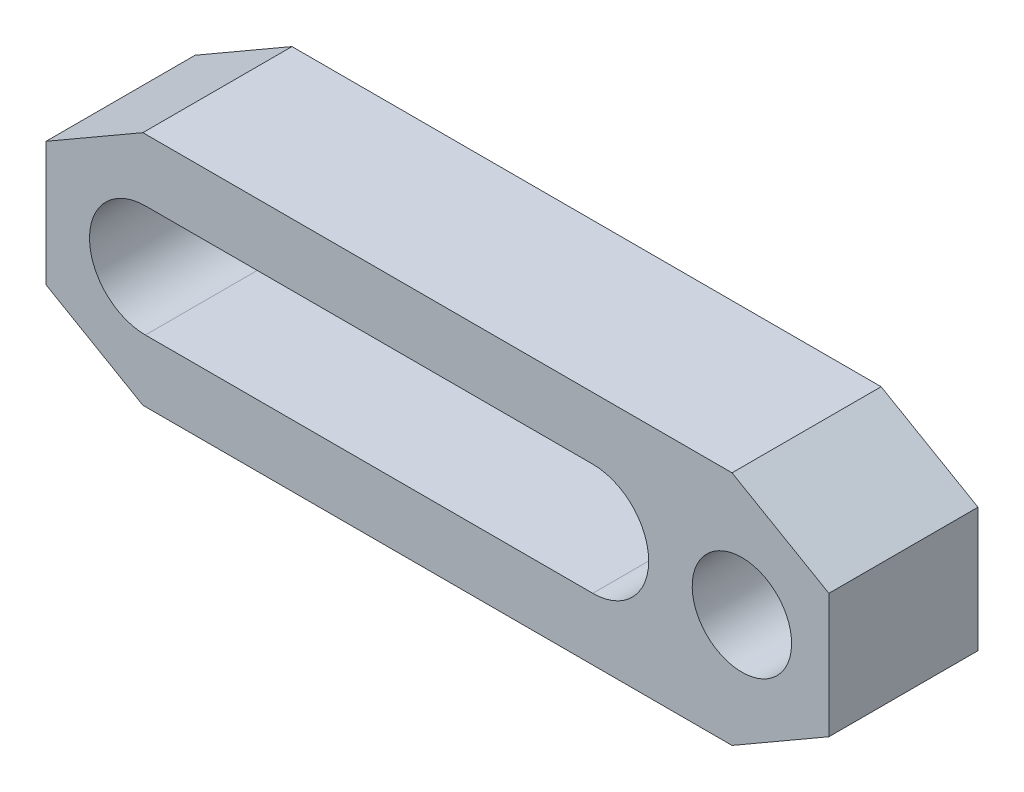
ISO-10303-21;
HEADER;
FILE_DESCRIPTION(('STEP AP214'),'2;1');
FILE_NAME('part.step','',(''),(''),'','','');
FILE_SCHEMA(('AUTOMOTIVE_DESIGN { 1 0 10303 214 1 1 1 1 }'));
ENDSEC;
DATA;
#1=APPLICATION_CONTEXT('core data for automotive mechanical design processes');
#2=APPLICATION_PROTOCOL_DEFINITION('international standard','automotive_design',2000,#1);
#3=PRODUCT_CONTEXT('',#1,'mechanical');
#4=PRODUCT('Part','Part','',(#3));
#5=PRODUCT_RELATED_PRODUCT_CATEGORY('part','',(#4));
#6=PRODUCT_DEFINITION_FORMATION('','',#4);
#7=PRODUCT_DEFINITION_CONTEXT('part definition',#1,'design');
#8=PRODUCT_DEFINITION('design','',#6,#7);
#9=PRODUCT_DEFINITION_SHAPE('','',#8);
#10=(LENGTH_UNIT() NAMED_UNIT(*) SI_UNIT(.MILLI.,.METRE.));
#11=(NAMED_UNIT(*) PLANE_ANGLE_UNIT() SI_UNIT($,.RADIAN.));
#12=(NAMED_UNIT(*) SI_UNIT($,.STERADIAN.) SOLID_ANGLE_UNIT());
#13=UNCERTAINTY_MEASURE_WITH_UNIT(LENGTH_MEASURE(1.E-05),#10,'distance_accuracy_value','');
#14=(GEOMETRIC_REPRESENTATION_CONTEXT(3) GLOBAL_UNCERTAINTY_ASSIGNED_CONTEXT((#13)) GLOBAL_UNIT_ASSIGNED_CONTEXT((#10,
#11,#12)) REPRESENTATION_CONTEXT('',''));
#15=CARTESIAN_POINT('',(0.,0.,0.));
#16=DIRECTION('',(0.,0.,1.));
#17=DIRECTION('',(1.,0.,0.));
#18=AXIS2_PLACEMENT_3D('',#15,#16,#17);
#19=CARTESIAN_POINT('',(-12.5,23.1865334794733,12.));
#20=DIRECTION('',(0.,0.,1.));
#21=DIRECTION('',(0.,1.,0.));
#22=AXIS2_PLACEMENT_3D('',#19,#20,#21);
#23=PLANE('',#22);
#24=CARTESIAN_POINT('',(12.,0.,12.));
#25=DIRECTION('',(0.,0.,1.));
#26=DIRECTION('',(0.,1.,0.));
#27=AXIS2_PLACEMENT_3D('',#24,#25,#26);
#28=CIRCLE('',#27,4.);
#29=CARTESIAN_POINT('',(12.,4.,12.));
#30=VERTEX_POINT('',#29);
#31=EDGE_CURVE('E124',#30,#30,#28,.T.);
#32=ORIENTED_EDGE('',*,*,#31,.F.);
#33=EDGE_LOOP('',(#32));
#34=FACE_BOUND('',#33,.T.);
#35=DIRECTION('',(-0.866025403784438,-0.5,0.));
#36=VECTOR('',#35,1.);
#37=CARTESIAN_POINT('',(-44.,5.,12.));
#38=LINE('',#37,#36);
#39=CARTESIAN_POINT('',(-36.2057713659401,9.5,12.));
#40=VERTEX_POINT('',#39);
#41=CARTESIAN_POINT('',(-44.,5.,12.));
#42=VERTEX_POINT('',#41);
#43=EDGE_CURVE('E160',#40,#42,#38,.T.);
#44=ORIENTED_EDGE('',*,*,#43,.T.);
#45=DIRECTION('',(0.,-1.,0.));
#46=VECTOR('',#45,1.);
#47=CARTESIAN_POINT('',(-44.,-5.,12.));
#48=LINE('',#47,#46);
#49=CARTESIAN_POINT('',(-44.,-5.,12.));
#50=VERTEX_POINT('',#49);
#51=EDGE_CURVE('E163',#42,#50,#48,.T.);
#52=ORIENTED_EDGE('',*,*,#51,.T.);
#53=DIRECTION('',(0.866025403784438,-0.5,0.));
#54=VECTOR('',#53,1.);
#55=CARTESIAN_POINT('',(-44.,-5.,12.));
#56=LINE('',#55,#54);
#57=CARTESIAN_POINT('',(-36.2057713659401,-9.5,12.));
#58=VERTEX_POINT('',#57);
#59=EDGE_CURVE('E165',#50,#58,#56,.T.);
#60=ORIENTED_EDGE('',*,*,#59,.T.);
#61=DIRECTION('',(1.,0.,0.));
#62=VECTOR('',#61,1.);
#63=CARTESIAN_POINT('',(11.2057713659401,-9.5,12.));
#64=LINE('',#63,#62);
#65=CARTESIAN_POINT('',(11.2057713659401,-9.5,12.));
#66=VERTEX_POINT('',#65);
#67=EDGE_CURVE('E167',#58,#66,#64,.T.);
#68=ORIENTED_EDGE('',*,*,#67,.T.);
#69=DIRECTION('',(0.866025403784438,0.5,0.));
#70=VECTOR('',#69,1.);
#71=CARTESIAN_POINT('',(19.,-5.,12.));
#72=LINE('',#71,#70);
#73=CARTESIAN_POINT('',(19.,-5.,12.));
#74=VERTEX_POINT('',#73);
#75=EDGE_CURVE('E169',#66,#74,#72,.T.);
#76=ORIENTED_EDGE('',*,*,#75,.T.);
#77=DIRECTION('',(0.,1.,0.));
#78=VECTOR('',#77,1.);
#79=CARTESIAN_POINT('',(19.,-5.,12.));
#80=LINE('',#79,#78);
#81=CARTESIAN_POINT('',(19.,5.,12.));
#82=VERTEX_POINT('',#81);
#83=EDGE_CURVE('E171',#74,#82,#80,.T.);
#84=ORIENTED_EDGE('',*,*,#83,.T.);
#85=DIRECTION('',(-0.866025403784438,0.5,0.));
#86=VECTOR('',#85,1.);
#87=CARTESIAN_POINT('',(19.,5.,12.));
#88=LINE('',#87,#86);
#89=CARTESIAN_POINT('',(11.2057713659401,9.5,12.));
#90=VERTEX_POINT('',#89);
#91=EDGE_CURVE('E173',#82,#90,#88,.T.);
#92=ORIENTED_EDGE('',*,*,#91,.T.);
#93=DIRECTION('',(-1.,0.,0.));
#94=VECTOR('',#93,1.);
#95=CARTESIAN_POINT('',(11.2057713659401,9.5,12.));
#96=LINE('',#95,#94);
#97=EDGE_CURVE('E175',#90,#40,#96,.T.);
#98=ORIENTED_EDGE('',*,*,#97,.T.);
#99=EDGE_LOOP('',(#44,#52,#60,#68,#76,#84,#92,#98));
#100=FACE_BOUND('',#99,.T.);
#101=DIRECTION('',(-1.,0.,0.));
#102=VECTOR('',#101,1.);
#103=CARTESIAN_POINT('',(0.,4.5,12.));
#104=LINE('',#103,#102);
#105=CARTESIAN_POINT('',(0.,4.5,12.));
#106=VERTEX_POINT('',#105);
#107=CARTESIAN_POINT('',(-36.,4.5,12.));
#108=VERTEX_POINT('',#107);
#109=EDGE_CURVE('E134',#106,#108,#104,.T.);
#110=ORIENTED_EDGE('',*,*,#109,.F.);
#111=CARTESIAN_POINT('',(0.,0.,12.));
#112=DIRECTION('',(0.,0.,1.));
#113=DIRECTION('',(0.,1.,0.));
#114=AXIS2_PLACEMENT_3D('',#111,#112,#113);
#115=CIRCLE('',#114,4.5);
#116=CARTESIAN_POINT('',(0.,-4.5,12.));
#117=VERTEX_POINT('',#116);
#118=EDGE_CURVE('E118',#117,#106,#115,.T.);
#119=ORIENTED_EDGE('',*,*,#118,.F.);
#120=DIRECTION('',(1.,0.,0.));
#121=VECTOR('',#120,1.);
#122=CARTESIAN_POINT('',(0.,-4.5,12.));
#123=LINE('',#122,#121);
#124=CARTESIAN_POINT('',(-36.,-4.5,12.));
#125=VERTEX_POINT('',#124);
#126=EDGE_CURVE('E138',#125,#117,#123,.T.);
#127=ORIENTED_EDGE('',*,*,#126,.F.);
#128=CARTESIAN_POINT('',(-36.,0.,12.));
#129=DIRECTION('',(0.,0.,1.));
#130=DIRECTION('',(0.,1.,0.));
#131=AXIS2_PLACEMENT_3D('',#128,#129,#130);
#132=CIRCLE('',#131,4.5);
#133=EDGE_CURVE('E136',#108,#125,#132,.T.);
#134=ORIENTED_EDGE('',*,*,#133,.F.);
#135=EDGE_LOOP('',(#110,#119,#127,#134));
#136=FACE_BOUND('',#135,.T.);
#137=ADVANCED_FACE('F14',(#34,#100,#136),#23,.T.);
#138=CARTESIAN_POINT('',(-12.5,23.1865334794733,0.));
#139=DIRECTION('',(0.,0.,1.));
#140=DIRECTION('',(0.,1.,0.));
#141=AXIS2_PLACEMENT_3D('',#138,#139,#140);
#142=PLANE('',#141);
#143=CARTESIAN_POINT('',(12.,0.,0.));
#144=DIRECTION('',(0.,0.,1.));
#145=DIRECTION('',(0.,1.,0.));
#146=AXIS2_PLACEMENT_3D('',#143,#144,#145);
#147=CIRCLE('',#146,4.);
#148=CARTESIAN_POINT('',(12.,4.,0.));
#149=VERTEX_POINT('',#148);
#150=EDGE_CURVE('E127',#149,#149,#147,.T.);
#151=ORIENTED_EDGE('',*,*,#150,.T.);
#152=EDGE_LOOP('',(#151));
#153=FACE_BOUND('',#152,.T.);
#154=DIRECTION('',(-0.866025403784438,-0.5,0.));
#155=VECTOR('',#154,1.);
#156=CARTESIAN_POINT('',(-44.,5.,0.));
#157=LINE('',#156,#155);
#158=CARTESIAN_POINT('',(-36.2057713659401,9.5,0.));
#159=VERTEX_POINT('',#158);
#160=CARTESIAN_POINT('',(-44.,5.,0.));
#161=VERTEX_POINT('',#160);
#162=EDGE_CURVE('E119',#159,#161,#157,.T.);
#163=ORIENTED_EDGE('',*,*,#162,.F.);
#164=DIRECTION('',(-1.,0.,0.));
#165=VECTOR('',#164,1.);
#166=CARTESIAN_POINT('',(11.2057713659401,9.5,0.));
#167=LINE('',#166,#165);
#168=CARTESIAN_POINT('',(11.2057713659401,9.5,0.));
#169=VERTEX_POINT('',#168);
#170=EDGE_CURVE('E158',#169,#159,#167,.T.);
#171=ORIENTED_EDGE('',*,*,#170,.F.);
#172=DIRECTION('',(-0.866025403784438,0.5,0.));
#173=VECTOR('',#172,1.);
#174=CARTESIAN_POINT('',(19.,5.,0.));
#175=LINE('',#174,#173);
#176=CARTESIAN_POINT('',(19.,5.,0.));
#177=VERTEX_POINT('',#176);
#178=EDGE_CURVE('E156',#177,#169,#175,.T.);
#179=ORIENTED_EDGE('',*,*,#178,.F.);
#180=DIRECTION('',(0.,1.,0.));
#181=VECTOR('',#180,1.);
#182=CARTESIAN_POINT('',(19.,-5.,0.));
#183=LINE('',#182,#181);
#184=CARTESIAN_POINT('',(19.,-5.,0.));
#185=VERTEX_POINT('',#184);
#186=EDGE_CURVE('E154',#185,#177,#183,.T.);
#187=ORIENTED_EDGE('',*,*,#186,.F.);
#188=DIRECTION('',(0.866025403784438,0.5,0.));
#189=VECTOR('',#188,1.);
#190=CARTESIAN_POINT('',(19.,-5.,0.));
#191=LINE('',#190,#189);
#192=CARTESIAN_POINT('',(11.2057713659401,-9.5,0.));
#193=VERTEX_POINT('',#192);
#194=EDGE_CURVE('E152',#193,#185,#191,.T.);
#195=ORIENTED_EDGE('',*,*,#194,.F.);
#196=DIRECTION('',(1.,0.,0.));
#197=VECTOR('',#196,1.);
#198=CARTESIAN_POINT('',(11.2057713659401,-9.5,0.));
#199=LINE('',#198,#197);
#200=CARTESIAN_POINT('',(-36.2057713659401,-9.5,0.));
#201=VERTEX_POINT('',#200);
#202=EDGE_CURVE('E150',#201,#193,#199,.T.);
#203=ORIENTED_EDGE('',*,*,#202,.F.);
#204=DIRECTION('',(0.866025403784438,-0.5,0.));
#205=VECTOR('',#204,1.);
#206=CARTESIAN_POINT('',(-44.,-5.,0.));
#207=LINE('',#206,#205);
#208=CARTESIAN_POINT('',(-44.,-5.,0.));
#209=VERTEX_POINT('',#208);
#210=EDGE_CURVE('E148',#209,#201,#207,.T.);
#211=ORIENTED_EDGE('',*,*,#210,.F.);
#212=DIRECTION('',(0.,-1.,0.));
#213=VECTOR('',#212,1.);
#214=CARTESIAN_POINT('',(-44.,-5.,0.));
#215=LINE('',#214,#213);
#216=EDGE_CURVE('E146',#161,#209,#215,.T.);
#217=ORIENTED_EDGE('',*,*,#216,.F.);
#218=EDGE_LOOP('',(#163,#171,#179,#187,#195,#203,#211,#217));
#219=FACE_BOUND('',#218,.T.);
#220=CARTESIAN_POINT('',(0.,0.,0.));
#221=DIRECTION('',(0.,0.,1.));
#222=DIRECTION('',(0.,1.,0.));
#223=AXIS2_PLACEMENT_3D('',#220,#221,#222);
#224=CIRCLE('',#223,4.5);
#225=CARTESIAN_POINT('',(0.,-4.5,0.));
#226=VERTEX_POINT('',#225);
#227=CARTESIAN_POINT('',(0.,4.5,0.));
#228=VERTEX_POINT('',#227);
#229=EDGE_CURVE('E37',#226,#228,#224,.T.);
#230=ORIENTED_EDGE('',*,*,#229,.T.);
#231=DIRECTION('',(-1.,0.,0.));
#232=VECTOR('',#231,1.);
#233=CARTESIAN_POINT('',(0.,4.5,0.));
#234=LINE('',#233,#232);
#235=CARTESIAN_POINT('',(-36.,4.5,0.));
#236=VERTEX_POINT('',#235);
#237=EDGE_CURVE('E105',#228,#236,#234,.T.);
#238=ORIENTED_EDGE('',*,*,#237,.T.);
#239=CARTESIAN_POINT('',(-36.,0.,0.));
#240=DIRECTION('',(0.,0.,1.));
#241=DIRECTION('',(0.,1.,0.));
#242=AXIS2_PLACEMENT_3D('',#239,#240,#241);
#243=CIRCLE('',#242,4.5);
#244=CARTESIAN_POINT('',(-36.,-4.5,0.));
#245=VERTEX_POINT('',#244);
#246=EDGE_CURVE('E114',#236,#245,#243,.T.);
#247=ORIENTED_EDGE('',*,*,#246,.T.);
#248=DIRECTION('',(1.,0.,0.));
#249=VECTOR('',#248,1.);
#250=CARTESIAN_POINT('',(0.,-4.5,0.));
#251=LINE('',#250,#249);
#252=EDGE_CURVE('E123',#245,#226,#251,.T.);
#253=ORIENTED_EDGE('',*,*,#252,.T.);
#254=EDGE_LOOP('',(#230,#238,#247,#253));
#255=FACE_BOUND('',#254,.T.);
#256=ADVANCED_FACE('F122',(#153,#219,#255),#142,.F.);
#257=CARTESIAN_POINT('',(-44.,5.,12.));
#258=DIRECTION('',(0.5,-0.866025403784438,0.));
#259=DIRECTION('',(0.866025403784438,0.5,0.));
#260=AXIS2_PLACEMENT_3D('',#257,#258,#259);
#261=PLANE('',#260);
#262=ORIENTED_EDGE('',*,*,#162,.T.);
#263=DIRECTION('',(0.,0.,-1.));
#264=VECTOR('',#263,1.);
#265=CARTESIAN_POINT('',(-44.,5.,12.));
#266=LINE('',#265,#264);
#267=EDGE_CURVE('E9',#42,#161,#266,.T.);
#268=ORIENTED_EDGE('',*,*,#267,.F.);
#269=ORIENTED_EDGE('',*,*,#43,.F.);
#270=DIRECTION('',(0.,0.,-1.));
#271=VECTOR('',#270,1.);
#272=CARTESIAN_POINT('',(-36.2057713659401,9.5,12.));
#273=LINE('',#272,#271);
#274=EDGE_CURVE('E177',#40,#159,#273,.T.);
#275=ORIENTED_EDGE('',*,*,#274,.T.);
#276=EDGE_LOOP('',(#262,#268,#269,#275));
#277=FACE_BOUND('',#276,.T.);
#278=ADVANCED_FACE('F16',(#277),#261,.F.);
#279=CARTESIAN_POINT('',(-44.,-5.,12.));
#280=DIRECTION('',(1.,0.,0.));
#281=DIRECTION('',(0.,1.,0.));
#282=AXIS2_PLACEMENT_3D('',#279,#280,#281);
#283=PLANE('',#282);
#284=ORIENTED_EDGE('',*,*,#216,.T.);
#285=DIRECTION('',(0.,0.,-1.));
#286=VECTOR('',#285,1.);
#287=CARTESIAN_POINT('',(-44.,-5.,12.));
#288=LINE('',#287,#286);
#289=EDGE_CURVE('E22',#50,#209,#288,.T.);
#290=ORIENTED_EDGE('',*,*,#289,.F.);
#291=ORIENTED_EDGE('',*,*,#51,.F.);
#292=ORIENTED_EDGE('',*,*,#267,.T.);
#293=EDGE_LOOP('',(#284,#290,#291,#292));
#294=FACE_BOUND('',#293,.T.);
#295=ADVANCED_FACE('F221',(#294),#283,.F.);
#296=CARTESIAN_POINT('',(-44.,-5.,12.));
#297=DIRECTION('',(0.5,0.866025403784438,0.));
#298=DIRECTION('',(-0.866025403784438,0.5,0.));
#299=AXIS2_PLACEMENT_3D('',#296,#297,#298);
#300=PLANE('',#299);
#301=ORIENTED_EDGE('',*,*,#210,.T.);
#302=DIRECTION('',(0.,0.,-1.));
#303=VECTOR('',#302,1.);
#304=CARTESIAN_POINT('',(-36.2057713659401,-9.5,12.));
#305=LINE('',#304,#303);
#306=EDGE_CURVE('E192',#58,#201,#305,.T.);
#307=ORIENTED_EDGE('',*,*,#306,.F.);
#308=ORIENTED_EDGE('',*,*,#59,.F.);
#309=ORIENTED_EDGE('',*,*,#289,.T.);
#310=EDGE_LOOP('',(#301,#307,#308,#309));
#311=FACE_BOUND('',#310,.T.);
#312=ADVANCED_FACE('F199',(#311),#300,.F.);
#313=CARTESIAN_POINT('',(11.2057713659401,-9.5,12.));
#314=DIRECTION('',(0.,1.,0.));
#315=DIRECTION('',(-1.,0.,0.));
#316=AXIS2_PLACEMENT_3D('',#313,#314,#315);
#317=PLANE('',#316);
#318=ORIENTED_EDGE('',*,*,#202,.T.);
#319=DIRECTION('',(0.,0.,-1.));
#320=VECTOR('',#319,1.);
#321=CARTESIAN_POINT('',(11.2057713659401,-9.5,12.));
#322=LINE('',#321,#320);
#323=EDGE_CURVE('E189',#66,#193,#322,.T.);
#324=ORIENTED_EDGE('',*,*,#323,.F.);
#325=ORIENTED_EDGE('',*,*,#67,.F.);
#326=ORIENTED_EDGE('',*,*,#306,.T.);
#327=EDGE_LOOP('',(#318,#324,#325,#326));
#328=FACE_BOUND('',#327,.T.);
#329=ADVANCED_FACE('F209',(#328),#317,.F.);
#330=CARTESIAN_POINT('',(19.,-5.,12.));
#331=DIRECTION('',(-0.5,0.866025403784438,0.));
#332=DIRECTION('',(-0.866025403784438,-0.5,0.));
#333=AXIS2_PLACEMENT_3D('',#330,#331,#332);
#334=PLANE('',#333);
#335=ORIENTED_EDGE('',*,*,#194,.T.);
#336=DIRECTION('',(0.,0.,-1.));
#337=VECTOR('',#336,1.);
#338=CARTESIAN_POINT('',(19.,-5.,12.));
#339=LINE('',#338,#337);
#340=EDGE_CURVE('E186',#74,#185,#339,.T.);
#341=ORIENTED_EDGE('',*,*,#340,.F.);
#342=ORIENTED_EDGE('',*,*,#75,.F.);
#343=ORIENTED_EDGE('',*,*,#323,.T.);
#344=EDGE_LOOP('',(#335,#341,#342,#343));
#345=FACE_BOUND('',#344,.T.);
#346=ADVANCED_FACE('F213',(#345),#334,.F.);
#347=CARTESIAN_POINT('',(19.,-5.,12.));
#348=DIRECTION('',(-1.,0.,0.));
#349=DIRECTION('',(0.,-1.,0.));
#350=AXIS2_PLACEMENT_3D('',#347,#348,#349);
#351=PLANE('',#350);
#352=ORIENTED_EDGE('',*,*,#186,.T.);
#353=DIRECTION('',(0.,0.,-1.));
#354=VECTOR('',#353,1.);
#355=CARTESIAN_POINT('',(19.,5.,12.));
#356=LINE('',#355,#354);
#357=EDGE_CURVE('E183',#82,#177,#356,.T.);
#358=ORIENTED_EDGE('',*,*,#357,.F.);
#359=ORIENTED_EDGE('',*,*,#83,.F.);
#360=ORIENTED_EDGE('',*,*,#340,.T.);
#361=EDGE_LOOP('',(#352,#358,#359,#360));
#362=FACE_BOUND('',#361,.T.);
#363=ADVANCED_FACE('F234',(#362),#351,.F.);
#364=CARTESIAN_POINT('',(19.,5.,12.));
#365=DIRECTION('',(-0.5,-0.866025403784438,0.));
#366=DIRECTION('',(0.866025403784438,-0.5,0.));
#367=AXIS2_PLACEMENT_3D('',#364,#365,#366);
#368=PLANE('',#367);
#369=ORIENTED_EDGE('',*,*,#178,.T.);
#370=DIRECTION('',(0.,0.,-1.));
#371=VECTOR('',#370,1.);
#372=CARTESIAN_POINT('',(11.2057713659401,9.5,12.));
#373=LINE('',#372,#371);
#374=EDGE_CURVE('E180',#90,#169,#373,.T.);
#375=ORIENTED_EDGE('',*,*,#374,.F.);
#376=ORIENTED_EDGE('',*,*,#91,.F.);
#377=ORIENTED_EDGE('',*,*,#357,.T.);
#378=EDGE_LOOP('',(#369,#375,#376,#377));
#379=FACE_BOUND('',#378,.T.);
#380=ADVANCED_FACE('F232',(#379),#368,.F.);
#381=CARTESIAN_POINT('',(11.2057713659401,9.5,12.));
#382=DIRECTION('',(0.,-1.,0.));
#383=DIRECTION('',(1.,0.,0.));
#384=AXIS2_PLACEMENT_3D('',#381,#382,#383);
#385=PLANE('',#384);
#386=ORIENTED_EDGE('',*,*,#170,.T.);
#387=ORIENTED_EDGE('',*,*,#274,.F.);
#388=ORIENTED_EDGE('',*,*,#97,.F.);
#389=ORIENTED_EDGE('',*,*,#374,.T.);
#390=EDGE_LOOP('',(#386,#387,#388,#389));
#391=FACE_BOUND('',#390,.T.);
#392=ADVANCED_FACE('F227',(#391),#385,.F.);
#393=CARTESIAN_POINT('',(0.,0.,12.));
#394=DIRECTION('',(0.,0.,-1.));
#395=DIRECTION('',(0.,-1.,0.));
#396=AXIS2_PLACEMENT_3D('',#393,#394,#395);
#397=CYLINDRICAL_SURFACE('',#396,4.5);
#398=ORIENTED_EDGE('',*,*,#229,.F.);
#399=DIRECTION('',(0.,0.,-1.));
#400=VECTOR('',#399,1.);
#401=CARTESIAN_POINT('',(0.,-4.5,12.));
#402=LINE('',#401,#400);
#403=EDGE_CURVE('E140',#117,#226,#402,.T.);
#404=ORIENTED_EDGE('',*,*,#403,.F.);
#405=ORIENTED_EDGE('',*,*,#118,.T.);
#406=DIRECTION('',(0.,0.,-1.));
#407=VECTOR('',#406,1.);
#408=CARTESIAN_POINT('',(0.,4.5,12.));
#409=LINE('',#408,#407);
#410=EDGE_CURVE('E107',#106,#228,#409,.T.);
#411=ORIENTED_EDGE('',*,*,#410,.T.);
#412=EDGE_LOOP('',(#398,#404,#405,#411));
#413=FACE_BOUND('',#412,.T.);
#414=ADVANCED_FACE('F116',(#413),#397,.F.);
#415=CARTESIAN_POINT('',(0.,4.5,12.));
#416=DIRECTION('',(0.,-1.,0.));
#417=DIRECTION('',(1.,0.,0.));
#418=AXIS2_PLACEMENT_3D('',#415,#416,#417);
#419=PLANE('',#418);
#420=ORIENTED_EDGE('',*,*,#237,.F.);
#421=ORIENTED_EDGE('',*,*,#410,.F.);
#422=ORIENTED_EDGE('',*,*,#109,.T.);
#423=DIRECTION('',(0.,0.,-1.));
#424=VECTOR('',#423,1.);
#425=CARTESIAN_POINT('',(-36.,4.5,12.));
#426=LINE('',#425,#424);
#427=EDGE_CURVE('E110',#108,#236,#426,.T.);
#428=ORIENTED_EDGE('',*,*,#427,.T.);
#429=EDGE_LOOP('',(#420,#421,#422,#428));
#430=FACE_BOUND('',#429,.T.);
#431=ADVANCED_FACE('F106',(#430),#419,.T.);
#432=CARTESIAN_POINT('',(-36.,0.,12.));
#433=DIRECTION('',(0.,0.,-1.));
#434=DIRECTION('',(0.,-1.,0.));
#435=AXIS2_PLACEMENT_3D('',#432,#433,#434);
#436=CYLINDRICAL_SURFACE('',#435,4.5);
#437=ORIENTED_EDGE('',*,*,#246,.F.);
#438=ORIENTED_EDGE('',*,*,#427,.F.);
#439=ORIENTED_EDGE('',*,*,#133,.T.);
#440=DIRECTION('',(0.,0.,-1.));
#441=VECTOR('',#440,1.);
#442=CARTESIAN_POINT('',(-36.,-4.5,12.));
#443=LINE('',#442,#441);
#444=EDGE_CURVE('E29',#125,#245,#443,.T.);
#445=ORIENTED_EDGE('',*,*,#444,.T.);
#446=EDGE_LOOP('',(#437,#438,#439,#445));
#447=FACE_BOUND('',#446,.T.);
#448=ADVANCED_FACE('F262',(#447),#436,.F.);
#449=CARTESIAN_POINT('',(0.,-4.5,12.));
#450=DIRECTION('',(0.,1.,0.));
#451=DIRECTION('',(-1.,0.,0.));
#452=AXIS2_PLACEMENT_3D('',#449,#450,#451);
#453=PLANE('',#452);
#454=ORIENTED_EDGE('',*,*,#252,.F.);
#455=ORIENTED_EDGE('',*,*,#444,.F.);
#456=ORIENTED_EDGE('',*,*,#126,.T.);
#457=ORIENTED_EDGE('',*,*,#403,.T.);
#458=EDGE_LOOP('',(#454,#455,#456,#457));
#459=FACE_BOUND('',#458,.T.);
#460=ADVANCED_FACE('F267',(#459),#453,.T.);
#461=CARTESIAN_POINT('',(12.,0.,12.));
#462=DIRECTION('',(0.,0.,1.));
#463=DIRECTION('',(0.,1.,0.));
#464=AXIS2_PLACEMENT_3D('',#461,#462,#463);
#465=CYLINDRICAL_SURFACE('',#464,4.);
#466=ORIENTED_EDGE('',*,*,#150,.F.);
#467=EDGE_LOOP('',(#466));
#468=FACE_BOUND('',#467,.T.);
#469=ORIENTED_EDGE('',*,*,#31,.T.);
#470=EDGE_LOOP('',(#469));
#471=FACE_BOUND('',#470,.T.);
#472=ADVANCED_FACE('F271',(#468,#471),#465,.F.);
#473=CLOSED_SHELL('',(#137,#256,#278,#295,#312,#329,#346,#363,#380,#392,#414,#431,#448,#460,#472));
#474=MANIFOLD_SOLID_BREP('B1',#473);
#475=ADVANCED_BREP_SHAPE_REPRESENTATION('',(#18,#474),#14);
#476=SHAPE_DEFINITION_REPRESENTATION(#9,#475);
ENDSEC;
END-ISO-10303-21;
